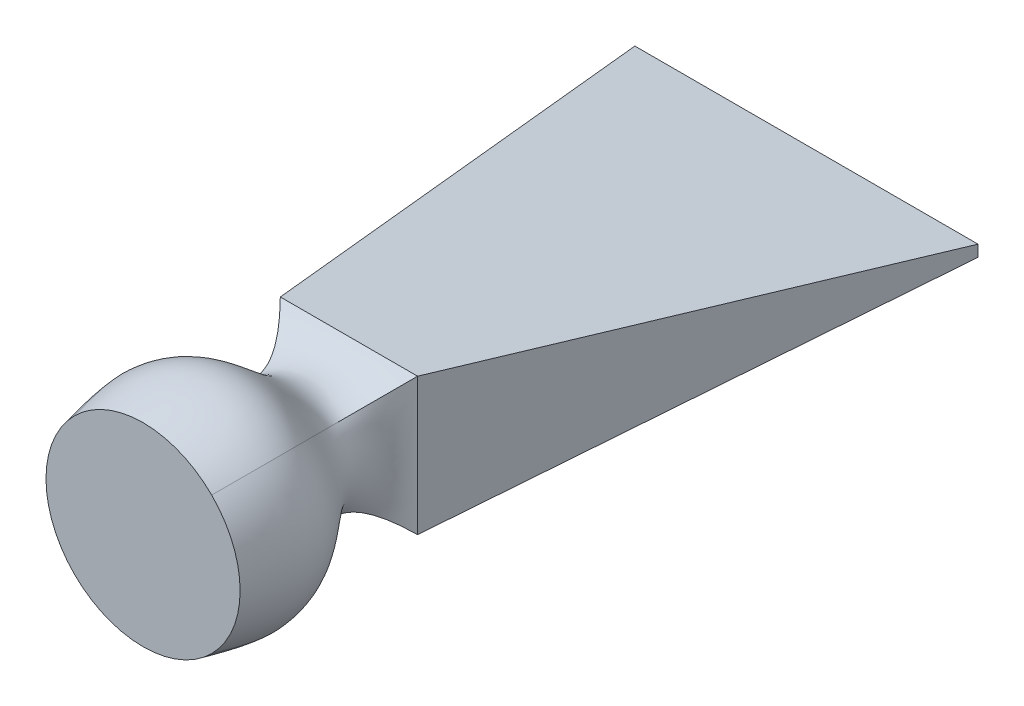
ISO-10303-21;
HEADER;
FILE_DESCRIPTION(('STEP AP214'),'2;1');
FILE_NAME('part.step','',(''),(''),'','','');
FILE_SCHEMA(('AUTOMOTIVE_DESIGN { 1 0 10303 214 1 1 1 1 }'));
ENDSEC;
DATA;
#1=APPLICATION_CONTEXT('core data for automotive mechanical design processes');
#2=APPLICATION_PROTOCOL_DEFINITION('international standard','automotive_design',2000,#1);
#3=PRODUCT_CONTEXT('',#1,'mechanical');
#4=PRODUCT('Part','Part','',(#3));
#5=PRODUCT_RELATED_PRODUCT_CATEGORY('part','',(#4));
#6=PRODUCT_DEFINITION_FORMATION('','',#4);
#7=PRODUCT_DEFINITION_CONTEXT('part definition',#1,'design');
#8=PRODUCT_DEFINITION('design','',#6,#7);
#9=PRODUCT_DEFINITION_SHAPE('','',#8);
#10=(LENGTH_UNIT() NAMED_UNIT(*) SI_UNIT(.MILLI.,.METRE.));
#11=(NAMED_UNIT(*) PLANE_ANGLE_UNIT() SI_UNIT($,.RADIAN.));
#12=(NAMED_UNIT(*) SI_UNIT($,.STERADIAN.) SOLID_ANGLE_UNIT());
#13=UNCERTAINTY_MEASURE_WITH_UNIT(LENGTH_MEASURE(1.E-05),#10,'distance_accuracy_value','');
#14=(GEOMETRIC_REPRESENTATION_CONTEXT(3) GLOBAL_UNCERTAINTY_ASSIGNED_CONTEXT((#13)) GLOBAL_UNIT_ASSIGNED_CONTEXT((#10,
#11,#12)) REPRESENTATION_CONTEXT('',''));
#15=CARTESIAN_POINT('',(0.,0.,0.));
#16=DIRECTION('',(0.,0.,1.));
#17=DIRECTION('',(1.,0.,0.));
#18=AXIS2_PLACEMENT_3D('',#15,#16,#17);
#19=CARTESIAN_POINT('',(0.,0.,90.));
#20=DIRECTION('',(0.,0.,1.));
#21=DIRECTION('',(1.,0.,0.));
#22=AXIS2_PLACEMENT_3D('',#19,#20,#21);
#23=PLANE('',#22);
#24=CARTESIAN_POINT('',(0.,0.,90.));
#25=DIRECTION('',(0.,0.,1.));
#26=DIRECTION('',(1.,0.,0.));
#27=AXIS2_PLACEMENT_3D('',#24,#25,#26);
#28=CIRCLE('',#27,42.43);
#29=CARTESIAN_POINT('',(-30.0025407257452,30.0025407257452,90.));
#30=VERTEX_POINT('',#29);
#31=CARTESIAN_POINT('',(-30.0025407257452,-30.0025407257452,90.));
#32=VERTEX_POINT('',#31);
#33=EDGE_CURVE('E114',#30,#32,#28,.T.);
#34=ORIENTED_EDGE('',*,*,#33,.T.);
#35=CARTESIAN_POINT('',(30.0025407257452,-30.0025407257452,90.));
#36=VERTEX_POINT('',#35);
#37=EDGE_CURVE('E106',#32,#36,#28,.T.);
#38=ORIENTED_EDGE('',*,*,#37,.T.);
#39=CARTESIAN_POINT('',(30.0025407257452,30.0025407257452,90.));
#40=VERTEX_POINT('',#39);
#41=EDGE_CURVE('E110',#36,#40,#28,.T.);
#42=ORIENTED_EDGE('',*,*,#41,.T.);
#43=EDGE_CURVE('E133',#40,#30,#28,.T.);
#44=ORIENTED_EDGE('',*,*,#43,.T.);
#45=EDGE_LOOP('',(#34,#38,#42,#44));
#46=FACE_BOUND('',#45,.T.);
#47=ADVANCED_FACE('F71',(#46),#23,.T.);
#48=CARTESIAN_POINT('',(30.,30.,0.));
#49=CARTESIAN_POINT('',(21.7846895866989,21.7846895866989,8.33375081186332));
#50=CARTESIAN_POINT('',(11.4475495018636,11.4475495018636,26.6852369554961));
#51=CARTESIAN_POINT('',(36.5909660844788,36.5909660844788,50.9553796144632));
#52=CARTESIAN_POINT('',(32.3611221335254,32.3611221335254,75.7722293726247));
#53=CARTESIAN_POINT('',(30.0025407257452,30.0025407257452,90.));
#54=CARTESIAN_POINT('',(10.,30.,0.));
#55=CARTESIAN_POINT('',(7.2615631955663,21.7846895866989,8.33375081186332));
#56=CARTESIAN_POINT('',(6.36952116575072,23.7298082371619,26.6852369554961));
#57=CARTESIAN_POINT('',(15.991841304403,54.8428691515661,50.9553796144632));
#58=CARTESIAN_POINT('',(14.2298819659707,48.9199746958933,75.7722293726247));
#59=CARTESIAN_POINT('',(13.4436881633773,46.5613932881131,90.));
#60=CARTESIAN_POINT('',(-10.,30.,0.));
#61=CARTESIAN_POINT('',(-7.26156319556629,21.7846895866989,8.33375081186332));
#62=CARTESIAN_POINT('',(-6.36952116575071,23.7298082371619,26.6852369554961));
#63=CARTESIAN_POINT('',(-15.991841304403,54.8428691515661,50.9553796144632));
#64=CARTESIAN_POINT('',(-14.2298819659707,48.9199746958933,75.7722293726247));
#65=CARTESIAN_POINT('',(-13.4436881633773,46.5613932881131,90.));
#66=CARTESIAN_POINT('',(-30.,30.,0.));
#67=CARTESIAN_POINT('',(-21.7846895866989,21.7846895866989,8.33375081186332));
#68=CARTESIAN_POINT('',(-11.4475495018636,11.4475495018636,26.6852369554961));
#69=CARTESIAN_POINT('',(-36.5909660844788,36.5909660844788,50.9553796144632));
#70=CARTESIAN_POINT('',(-32.3611221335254,32.3611221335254,75.7722293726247));
#71=CARTESIAN_POINT('',(-30.0025407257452,30.0025407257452,90.));
#72=B_SPLINE_SURFACE_WITH_KNOTS('',3,3,((#48,#49,#50,#51,#52,#53),(#54,#55,#56,#57,#58,#59),
(#60,#61,#62,#63,#64,#65),(#66,#67,#68,#69,#70,#71)),.UNSPECIFIED.,.F.,.F.,.F.,(4,4),(4,1,1,4),
(0.,1.),(0.,0.284220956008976,0.593747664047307,1.),.UNSPECIFIED.);
#73=DIRECTION('',(-1.,0.,0.));
#74=VECTOR('',#73,1.);
#75=CARTESIAN_POINT('',(-30.,30.,0.));
#76=LINE('',#75,#74);
#77=CARTESIAN_POINT('',(30.,30.,0.));
#78=VERTEX_POINT('',#77);
#79=CARTESIAN_POINT('',(-30.,30.,0.));
#80=VERTEX_POINT('',#79);
#81=EDGE_CURVE('E429',#78,#80,#76,.T.);
#82=CARTESIAN_POINT('',(-30.,30.,0.));
#83=CARTESIAN_POINT('',(-21.7846895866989,21.7846895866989,8.33375081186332));
#84=CARTESIAN_POINT('',(-11.4475495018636,11.4475495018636,26.6852369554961));
#85=CARTESIAN_POINT('',(-36.5909660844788,36.5909660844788,50.9553796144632));
#86=CARTESIAN_POINT('',(-32.3611221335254,32.3611221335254,75.7722293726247));
#87=CARTESIAN_POINT('',(-30.0025407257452,30.0025407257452,90.));
#88=B_SPLINE_CURVE_WITH_KNOTS('',3,(#82,#83,#84,#85,#86,#87),.UNSPECIFIED.,.F.,.F.,(4,1,1,4),
(0.,0.284220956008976,0.593747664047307,1.),.UNSPECIFIED.);
#89=EDGE_CURVE('E154',#80,#30,#88,.T.);
#90=CARTESIAN_POINT('',(30.,30.,0.));
#91=CARTESIAN_POINT('',(21.7846895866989,21.7846895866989,8.33375081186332));
#92=CARTESIAN_POINT('',(11.4475495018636,11.4475495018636,26.6852369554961));
#93=CARTESIAN_POINT('',(36.5909660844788,36.5909660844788,50.9553796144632));
#94=CARTESIAN_POINT('',(32.3611221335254,32.3611221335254,75.7722293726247));
#95=CARTESIAN_POINT('',(30.0025407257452,30.0025407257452,90.));
#96=B_SPLINE_CURVE_WITH_KNOTS('',3,(#90,#91,#92,#93,#94,#95),.UNSPECIFIED.,.F.,.F.,(4,1,1,4),
(0.,0.284220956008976,0.593747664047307,1.),.UNSPECIFIED.);
#97=EDGE_CURVE('E132',#40,#78,#96,.F.);
#98=ORIENTED_EDGE('',*,*,#81,.T.);
#99=ORIENTED_EDGE('',*,*,#89,.T.);
#100=ORIENTED_EDGE('',*,*,#43,.F.);
#101=ORIENTED_EDGE('',*,*,#97,.T.);
#102=EDGE_LOOP('',(#98,#99,#100,#101));
#103=FACE_BOUND('',#102,.T.);
#104=ADVANCED_FACE('F177',(#103),#72,.T.);
#105=CARTESIAN_POINT('',(-30.,30.,0.));
#106=CARTESIAN_POINT('',(-21.7846895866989,21.7846895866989,8.33375081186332));
#107=CARTESIAN_POINT('',(-11.4475495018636,11.4475495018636,26.6852369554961));
#108=CARTESIAN_POINT('',(-36.5909660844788,36.5909660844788,50.9553796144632));
#109=CARTESIAN_POINT('',(-32.3611221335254,32.3611221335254,75.7722293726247));
#110=CARTESIAN_POINT('',(-30.0025407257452,30.0025407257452,90.));
#111=CARTESIAN_POINT('',(-30.,10.,0.));
#112=CARTESIAN_POINT('',(-21.7846895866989,7.2615631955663,8.33375081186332));
#113=CARTESIAN_POINT('',(-23.7298082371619,6.36952116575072,26.6852369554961));
#114=CARTESIAN_POINT('',(-54.8428691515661,15.991841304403,50.9553796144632));
#115=CARTESIAN_POINT('',(-48.9199746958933,14.2298819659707,75.7722293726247));
#116=CARTESIAN_POINT('',(-46.5613932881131,13.4436881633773,90.));
#117=CARTESIAN_POINT('',(-30.,-10.,0.));
#118=CARTESIAN_POINT('',(-21.7846895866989,-7.2615631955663,8.33375081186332));
#119=CARTESIAN_POINT('',(-23.7298082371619,-6.36952116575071,26.6852369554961));
#120=CARTESIAN_POINT('',(-54.8428691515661,-15.991841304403,50.9553796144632));
#121=CARTESIAN_POINT('',(-48.9199746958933,-14.2298819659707,75.7722293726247));
#122=CARTESIAN_POINT('',(-46.5613932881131,-13.4436881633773,90.));
#123=CARTESIAN_POINT('',(-30.,-30.,0.));
#124=CARTESIAN_POINT('',(-21.7846895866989,-21.7846895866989,8.33375081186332));
#125=CARTESIAN_POINT('',(-11.4475495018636,-11.4475495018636,26.6852369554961));
#126=CARTESIAN_POINT('',(-36.5909660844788,-36.5909660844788,50.9553796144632));
#127=CARTESIAN_POINT('',(-32.3611221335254,-32.3611221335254,75.7722293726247));
#128=CARTESIAN_POINT('',(-30.0025407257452,-30.0025407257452,90.));
#129=B_SPLINE_SURFACE_WITH_KNOTS('',3,3,((#105,#106,#107,#108,#109,#110),(#111,#112,#113,#114,
#115,#116),(#117,#118,#119,#120,#121,#122),(#123,#124,#125,#126,#127,#128)),.UNSPECIFIED.,.F.,
.F.,.F.,(4,4),(4,1,1,4),(0.,1.),(0.,0.284220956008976,0.593747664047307,1.),.UNSPECIFIED.);
#130=DIRECTION('',(0.,-1.,0.));
#131=VECTOR('',#130,1.);
#132=CARTESIAN_POINT('',(-30.,-30.,0.));
#133=LINE('',#132,#131);
#134=CARTESIAN_POINT('',(-30.,-30.,0.));
#135=VERTEX_POINT('',#134);
#136=EDGE_CURVE('E81',#80,#135,#133,.T.);
#137=CARTESIAN_POINT('',(-30.,-30.,0.));
#138=CARTESIAN_POINT('',(-21.7846895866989,-21.7846895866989,8.33375081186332));
#139=CARTESIAN_POINT('',(-11.4475495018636,-11.4475495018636,26.6852369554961));
#140=CARTESIAN_POINT('',(-36.5909660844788,-36.5909660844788,50.9553796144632));
#141=CARTESIAN_POINT('',(-32.3611221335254,-32.3611221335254,75.7722293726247));
#142=CARTESIAN_POINT('',(-30.0025407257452,-30.0025407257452,90.));
#143=B_SPLINE_CURVE_WITH_KNOTS('',3,(#137,#138,#139,#140,#141,#142),.UNSPECIFIED.,.F.,.F.,(4,1,
1,4),(0.,0.284220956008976,0.593747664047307,1.),.UNSPECIFIED.);
#144=EDGE_CURVE('E138',#135,#32,#143,.T.);
#145=ORIENTED_EDGE('',*,*,#136,.T.);
#146=ORIENTED_EDGE('',*,*,#144,.T.);
#147=ORIENTED_EDGE('',*,*,#33,.F.);
#148=ORIENTED_EDGE('',*,*,#89,.F.);
#149=EDGE_LOOP('',(#145,#146,#147,#148));
#150=FACE_BOUND('',#149,.T.);
#151=ADVANCED_FACE('F189',(#150),#129,.T.);
#152=CARTESIAN_POINT('',(30.,-30.,0.));
#153=CARTESIAN_POINT('',(21.7846895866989,-21.7846895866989,8.33375081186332));
#154=CARTESIAN_POINT('',(11.4475495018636,-11.4475495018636,26.6852369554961));
#155=CARTESIAN_POINT('',(36.5909660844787,-36.5909660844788,50.9553796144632));
#156=CARTESIAN_POINT('',(32.3611221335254,-32.3611221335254,75.7722293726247));
#157=CARTESIAN_POINT('',(30.0025407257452,-30.0025407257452,90.));
#158=CARTESIAN_POINT('',(30.,-10.,0.));
#159=CARTESIAN_POINT('',(21.7846895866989,-7.2615631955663,8.33375081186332));
#160=CARTESIAN_POINT('',(23.7298082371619,-6.36952116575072,26.6852369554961));
#161=CARTESIAN_POINT('',(54.8428691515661,-15.991841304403,50.9553796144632));
#162=CARTESIAN_POINT('',(48.9199746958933,-14.2298819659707,75.7722293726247));
#163=CARTESIAN_POINT('',(46.5613932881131,-13.4436881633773,90.));
#164=CARTESIAN_POINT('',(30.,10.,0.));
#165=CARTESIAN_POINT('',(21.7846895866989,7.2615631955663,8.33375081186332));
#166=CARTESIAN_POINT('',(23.7298082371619,6.3695211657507,26.6852369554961));
#167=CARTESIAN_POINT('',(54.8428691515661,15.991841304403,50.9553796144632));
#168=CARTESIAN_POINT('',(48.9199746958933,14.2298819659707,75.7722293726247));
#169=CARTESIAN_POINT('',(46.5613932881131,13.4436881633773,90.));
#170=CARTESIAN_POINT('',(30.,30.,0.));
#171=CARTESIAN_POINT('',(21.7846895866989,21.7846895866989,8.33375081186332));
#172=CARTESIAN_POINT('',(11.4475495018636,11.4475495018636,26.6852369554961));
#173=CARTESIAN_POINT('',(36.5909660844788,36.5909660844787,50.9553796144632));
#174=CARTESIAN_POINT('',(32.3611221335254,32.3611221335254,75.7722293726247));
#175=CARTESIAN_POINT('',(30.0025407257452,30.0025407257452,90.));
#176=B_SPLINE_SURFACE_WITH_KNOTS('',3,3,((#152,#153,#154,#155,#156,#157),(#158,#159,#160,#161,
#162,#163),(#164,#165,#166,#167,#168,#169),(#170,#171,#172,#173,#174,#175)),.UNSPECIFIED.,.F.,
.F.,.F.,(4,4),(4,1,1,4),(0.,1.),(0.,0.284220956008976,0.593747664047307,1.),.UNSPECIFIED.);
#177=DIRECTION('',(0.,1.,0.));
#178=VECTOR('',#177,1.);
#179=CARTESIAN_POINT('',(30.,-30.,0.));
#180=LINE('',#179,#178);
#181=CARTESIAN_POINT('',(30.,-30.,0.));
#182=VERTEX_POINT('',#181);
#183=EDGE_CURVE('E163',#182,#78,#180,.T.);
#184=CARTESIAN_POINT('',(30.,-30.,0.));
#185=CARTESIAN_POINT('',(21.7846895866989,-21.7846895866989,8.33375081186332));
#186=CARTESIAN_POINT('',(11.4475495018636,-11.4475495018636,26.6852369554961));
#187=CARTESIAN_POINT('',(36.5909660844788,-36.5909660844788,50.9553796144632));
#188=CARTESIAN_POINT('',(32.3611221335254,-32.3611221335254,75.7722293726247));
#189=CARTESIAN_POINT('',(30.0025407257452,-30.0025407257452,90.));
#190=B_SPLINE_CURVE_WITH_KNOTS('',3,(#184,#185,#186,#187,#188,#189),.UNSPECIFIED.,.F.,.F.,(4,1,
1,4),(0.,0.284220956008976,0.593747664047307,1.),.UNSPECIFIED.);
#191=EDGE_CURVE('E130',#182,#36,#190,.T.);
#192=ORIENTED_EDGE('',*,*,#183,.T.);
#193=ORIENTED_EDGE('',*,*,#97,.F.);
#194=ORIENTED_EDGE('',*,*,#41,.F.);
#195=ORIENTED_EDGE('',*,*,#191,.F.);
#196=EDGE_LOOP('',(#192,#193,#194,#195));
#197=FACE_BOUND('',#196,.T.);
#198=ADVANCED_FACE('F129',(#197),#176,.T.);
#199=CARTESIAN_POINT('',(-30.,-30.,0.));
#200=CARTESIAN_POINT('',(-21.7846895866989,-21.7846895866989,8.33375081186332));
#201=CARTESIAN_POINT('',(-11.4475495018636,-11.4475495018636,26.6852369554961));
#202=CARTESIAN_POINT('',(-36.5909660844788,-36.5909660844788,50.9553796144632));
#203=CARTESIAN_POINT('',(-32.3611221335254,-32.3611221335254,75.7722293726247));
#204=CARTESIAN_POINT('',(-30.0025407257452,-30.0025407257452,90.));
#205=CARTESIAN_POINT('',(-10.,-30.,0.));
#206=CARTESIAN_POINT('',(-7.2615631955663,-21.7846895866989,8.33375081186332));
#207=CARTESIAN_POINT('',(-6.36952116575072,-23.7298082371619,26.6852369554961));
#208=CARTESIAN_POINT('',(-15.991841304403,-54.8428691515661,50.9553796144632));
#209=CARTESIAN_POINT('',(-14.2298819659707,-48.9199746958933,75.7722293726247));
#210=CARTESIAN_POINT('',(-13.4436881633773,-46.5613932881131,90.));
#211=CARTESIAN_POINT('',(10.,-30.,0.));
#212=CARTESIAN_POINT('',(7.26156319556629,-21.7846895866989,8.33375081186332));
#213=CARTESIAN_POINT('',(6.36952116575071,-23.7298082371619,26.6852369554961));
#214=CARTESIAN_POINT('',(15.991841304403,-54.8428691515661,50.9553796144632));
#215=CARTESIAN_POINT('',(14.2298819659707,-48.9199746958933,75.7722293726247));
#216=CARTESIAN_POINT('',(13.4436881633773,-46.5613932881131,90.));
#217=CARTESIAN_POINT('',(30.,-30.,0.));
#218=CARTESIAN_POINT('',(21.7846895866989,-21.7846895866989,8.33375081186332));
#219=CARTESIAN_POINT('',(11.4475495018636,-11.4475495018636,26.6852369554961));
#220=CARTESIAN_POINT('',(36.5909660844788,-36.5909660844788,50.9553796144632));
#221=CARTESIAN_POINT('',(32.3611221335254,-32.3611221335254,75.7722293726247));
#222=CARTESIAN_POINT('',(30.0025407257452,-30.0025407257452,90.));
#223=B_SPLINE_SURFACE_WITH_KNOTS('',3,3,((#199,#200,#201,#202,#203,#204),(#205,#206,#207,#208,
#209,#210),(#211,#212,#213,#214,#215,#216),(#217,#218,#219,#220,#221,#222)),.UNSPECIFIED.,.F.,
.F.,.F.,(4,4),(4,1,1,4),(0.,1.),(0.,0.284220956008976,0.593747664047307,1.),.UNSPECIFIED.);
#224=DIRECTION('',(1.,0.,0.));
#225=VECTOR('',#224,1.);
#226=CARTESIAN_POINT('',(-30.,-30.,0.));
#227=LINE('',#226,#225);
#228=EDGE_CURVE('E12',#135,#182,#227,.T.);
#229=ORIENTED_EDGE('',*,*,#228,.T.);
#230=ORIENTED_EDGE('',*,*,#191,.T.);
#231=ORIENTED_EDGE('',*,*,#37,.F.);
#232=ORIENTED_EDGE('',*,*,#144,.F.);
#233=EDGE_LOOP('',(#229,#230,#231,#232));
#234=FACE_BOUND('',#233,.T.);
#235=ADVANCED_FACE('F137',(#234),#223,.T.);
#236=CARTESIAN_POINT('',(75.,2.5,-200.));
#237=DIRECTION('',(0.,0.,-1.));
#238=DIRECTION('',(-1.,0.,0.));
#239=AXIS2_PLACEMENT_3D('',#236,#237,#238);
#240=PLANE('',#239);
#241=DIRECTION('',(0.,1.,0.));
#242=VECTOR('',#241,1.);
#243=CARTESIAN_POINT('',(75.,-2.5,-200.));
#244=LINE('',#243,#242);
#245=CARTESIAN_POINT('',(75.,-2.5,-200.));
#246=VERTEX_POINT('',#245);
#247=CARTESIAN_POINT('',(75.,2.5,-200.));
#248=VERTEX_POINT('',#247);
#249=EDGE_CURVE('E332',#246,#248,#244,.T.);
#250=ORIENTED_EDGE('',*,*,#249,.F.);
#251=DIRECTION('',(1.,0.,0.));
#252=VECTOR('',#251,1.);
#253=CARTESIAN_POINT('',(-75.,-2.5,-200.));
#254=LINE('',#253,#252);
#255=CARTESIAN_POINT('',(-75.,-2.5,-200.));
#256=VERTEX_POINT('',#255);
#257=EDGE_CURVE('E315',#256,#246,#254,.T.);
#258=ORIENTED_EDGE('',*,*,#257,.F.);
#259=DIRECTION('',(0.,-1.,0.));
#260=VECTOR('',#259,1.);
#261=CARTESIAN_POINT('',(-75.,-2.5,-200.));
#262=LINE('',#261,#260);
#263=CARTESIAN_POINT('',(-75.,2.5,-200.));
#264=VERTEX_POINT('',#263);
#265=EDGE_CURVE('E364',#264,#256,#262,.T.);
#266=ORIENTED_EDGE('',*,*,#265,.F.);
#267=DIRECTION('',(-1.,0.,0.));
#268=VECTOR('',#267,1.);
#269=CARTESIAN_POINT('',(-75.,2.5,-200.));
#270=LINE('',#269,#268);
#271=EDGE_CURVE('E395',#248,#264,#270,.T.);
#272=ORIENTED_EDGE('',*,*,#271,.F.);
#273=EDGE_LOOP('',(#250,#258,#266,#272));
#274=FACE_BOUND('',#273,.T.);
#275=ADVANCED_FACE('F233',(#274),#240,.T.);
#276=CARTESIAN_POINT('',(-30.,30.,0.));
#277=DIRECTION('',(0.,-0.990678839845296,0.136218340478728));
#278=DIRECTION('',(0.,-0.136218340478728,-0.990678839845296));
#279=AXIS2_PLACEMENT_3D('',#276,#277,#278);
#280=PLANE('',#279);
#281=DIRECTION('',(0.217563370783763,0.132955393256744,0.966948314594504));
#282=VECTOR('',#281,1.);
#283=CARTESIAN_POINT('',(-75.,2.5,-200.));
#284=LINE('',#283,#282);
#285=EDGE_CURVE('E322',#264,#80,#284,.T.);
#286=ORIENTED_EDGE('',*,*,#285,.T.);
#287=ORIENTED_EDGE('',*,*,#81,.F.);
#288=DIRECTION('',(-0.217563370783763,0.132955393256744,0.966948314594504));
#289=VECTOR('',#288,1.);
#290=CARTESIAN_POINT('',(75.,2.5,-200.));
#291=LINE('',#290,#289);
#292=EDGE_CURVE('E337',#248,#78,#291,.T.);
#293=ORIENTED_EDGE('',*,*,#292,.F.);
#294=ORIENTED_EDGE('',*,*,#271,.T.);
#295=EDGE_LOOP('',(#286,#287,#293,#294));
#296=FACE_BOUND('',#295,.T.);
#297=ADVANCED_FACE('F190',(#296),#280,.F.);
#298=CARTESIAN_POINT('',(30.,30.,0.));
#299=DIRECTION('',(-0.975609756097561,0.,-0.219512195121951));
#300=DIRECTION('',(-0.219512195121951,0.,0.975609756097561));
#301=AXIS2_PLACEMENT_3D('',#298,#299,#300);
#302=PLANE('',#301);
#303=ORIENTED_EDGE('',*,*,#292,.T.);
#304=ORIENTED_EDGE('',*,*,#183,.F.);
#305=DIRECTION('',(-0.217563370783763,-0.132955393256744,0.966948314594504));
#306=VECTOR('',#305,1.);
#307=CARTESIAN_POINT('',(75.,-2.5,-200.));
#308=LINE('',#307,#306);
#309=EDGE_CURVE('E312',#246,#182,#308,.T.);
#310=ORIENTED_EDGE('',*,*,#309,.F.);
#311=ORIENTED_EDGE('',*,*,#249,.T.);
#312=EDGE_LOOP('',(#303,#304,#310,#311));
#313=FACE_BOUND('',#312,.T.);
#314=ADVANCED_FACE('F279',(#313),#302,.F.);
#315=CARTESIAN_POINT('',(-30.,-30.,0.));
#316=DIRECTION('',(0.975609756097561,0.,-0.219512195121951));
#317=DIRECTION('',(-0.219512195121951,0.,-0.975609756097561));
#318=AXIS2_PLACEMENT_3D('',#315,#316,#317);
#319=PLANE('',#318);
#320=DIRECTION('',(0.217563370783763,-0.132955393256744,0.966948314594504));
#321=VECTOR('',#320,1.);
#322=CARTESIAN_POINT('',(-75.,-2.5,-200.));
#323=LINE('',#322,#321);
#324=EDGE_CURVE('E89',#256,#135,#323,.T.);
#325=ORIENTED_EDGE('',*,*,#324,.T.);
#326=ORIENTED_EDGE('',*,*,#136,.F.);
#327=ORIENTED_EDGE('',*,*,#285,.F.);
#328=ORIENTED_EDGE('',*,*,#265,.T.);
#329=EDGE_LOOP('',(#325,#326,#327,#328));
#330=FACE_BOUND('',#329,.T.);
#331=ADVANCED_FACE('F289',(#330),#319,.F.);
#332=CARTESIAN_POINT('',(30.,-30.,0.));
#333=DIRECTION('',(0.,0.990678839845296,0.136218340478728));
#334=DIRECTION('',(0.,-0.136218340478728,0.990678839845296));
#335=AXIS2_PLACEMENT_3D('',#332,#333,#334);
#336=PLANE('',#335);
#337=ORIENTED_EDGE('',*,*,#309,.T.);
#338=ORIENTED_EDGE('',*,*,#228,.F.);
#339=ORIENTED_EDGE('',*,*,#324,.F.);
#340=ORIENTED_EDGE('',*,*,#257,.T.);
#341=EDGE_LOOP('',(#337,#338,#339,#340));
#342=FACE_BOUND('',#341,.T.);
#343=ADVANCED_FACE('F191',(#342),#336,.F.);
#344=CLOSED_SHELL('',(#47,#104,#151,#198,#235,#275,#297,#314,#331,#343));
#345=MANIFOLD_SOLID_BREP('B2',#344);
#346=ADVANCED_BREP_SHAPE_REPRESENTATION('',(#18,#345),#14);
#347=SHAPE_DEFINITION_REPRESENTATION(#9,#346);
ENDSEC;
END-ISO-10303-21;
